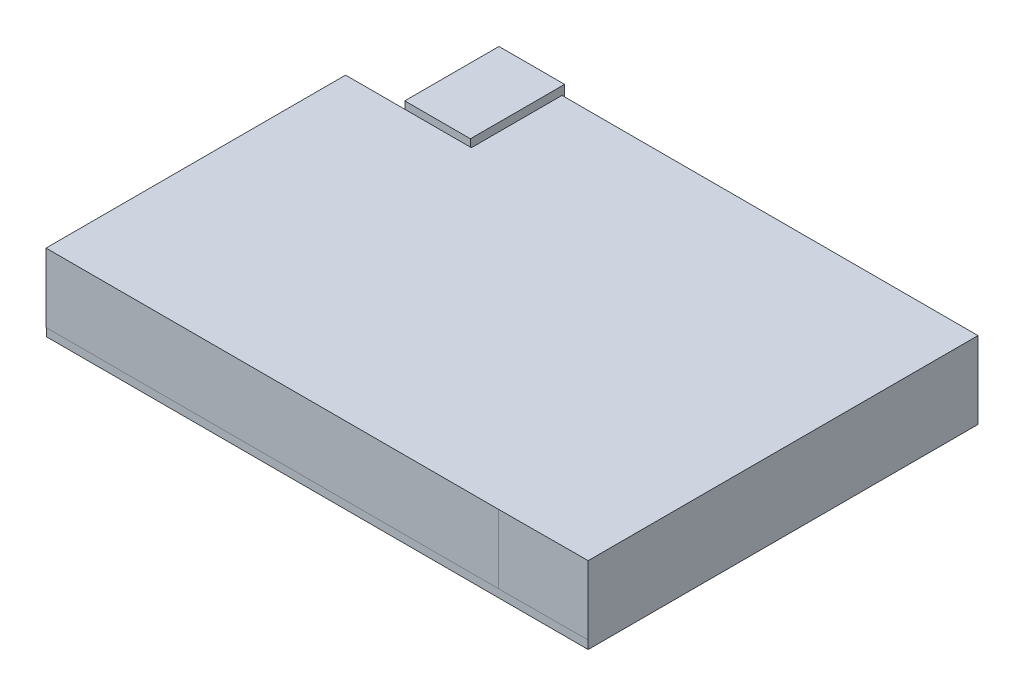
ISO-10303-21;
HEADER;
FILE_DESCRIPTION(('STEP AP214'),'2;1');
FILE_NAME('part.step','',(''),(''),'','','');
FILE_SCHEMA(('AUTOMOTIVE_DESIGN { 1 0 10303 214 1 1 1 1 }'));
ENDSEC;
DATA;
#1=APPLICATION_CONTEXT('core data for automotive mechanical design processes');
#2=APPLICATION_PROTOCOL_DEFINITION('international standard','automotive_design',2000,#1);
#3=PRODUCT_CONTEXT('',#1,'mechanical');
#4=PRODUCT('Part','Part','',(#3));
#5=PRODUCT_RELATED_PRODUCT_CATEGORY('part','',(#4));
#6=PRODUCT_DEFINITION_FORMATION('','',#4);
#7=PRODUCT_DEFINITION_CONTEXT('part definition',#1,'design');
#8=PRODUCT_DEFINITION('design','',#6,#7);
#9=PRODUCT_DEFINITION_SHAPE('','',#8);
#10=(LENGTH_UNIT() NAMED_UNIT(*) SI_UNIT(.MILLI.,.METRE.));
#11=(NAMED_UNIT(*) PLANE_ANGLE_UNIT() SI_UNIT($,.RADIAN.));
#12=(NAMED_UNIT(*) SI_UNIT($,.STERADIAN.) SOLID_ANGLE_UNIT());
#13=UNCERTAINTY_MEASURE_WITH_UNIT(LENGTH_MEASURE(1.E-05),#10,'distance_accuracy_value','');
#14=(GEOMETRIC_REPRESENTATION_CONTEXT(3) GLOBAL_UNCERTAINTY_ASSIGNED_CONTEXT((#13)) GLOBAL_UNIT_ASSIGNED_CONTEXT((#10,
#11,#12)) REPRESENTATION_CONTEXT('',''));
#15=CARTESIAN_POINT('',(0.,0.,0.));
#16=DIRECTION('',(0.,0.,1.));
#17=DIRECTION('',(1.,0.,0.));
#18=AXIS2_PLACEMENT_3D('',#15,#16,#17);
#19=CARTESIAN_POINT('',(0.,1.524,0.));
#20=DIRECTION('',(0.,1.,0.));
#21=DIRECTION('',(0.,0.,1.));
#22=AXIS2_PLACEMENT_3D('',#19,#20,#21);
#23=PLANE('',#22);
#24=CARTESIAN_POINT('',(-47.0916,1.524,-32.9565));
#25=DIRECTION('',(0.,1.,0.));
#26=DIRECTION('',(0.,0.,1.));
#27=AXIS2_PLACEMENT_3D('',#24,#25,#26);
#28=CIRCLE('',#27,1.72719999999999);
#29=CARTESIAN_POINT('',(-47.0916,1.524,-31.2293));
#30=VERTEX_POINT('',#29);
#31=EDGE_CURVE('E205',#30,#30,#28,.T.);
#32=ORIENTED_EDGE('',*,*,#31,.F.);
#33=EDGE_LOOP('',(#32));
#34=FACE_BOUND('',#33,.T.);
#35=DIRECTION('',(-1.,0.,0.));
#36=VECTOR('',#35,1.);
#37=CARTESIAN_POINT('',(-50.038,1.524,-19.2623606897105));
#38=LINE('',#37,#36);
#39=CARTESIAN_POINT('',(-26.8018549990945,1.524,-19.2623606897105));
#40=VERTEX_POINT('',#39);
#41=CARTESIAN_POINT('',(-50.038,1.524,-19.2623606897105));
#42=VERTEX_POINT('',#41);
#43=EDGE_CURVE('E157',#40,#42,#38,.T.);
#44=ORIENTED_EDGE('',*,*,#43,.F.);
#45=DIRECTION('',(0.,0.,1.));
#46=VECTOR('',#45,1.);
#47=CARTESIAN_POINT('',(-26.8018549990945,1.524,-19.2623606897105));
#48=LINE('',#47,#46);
#49=CARTESIAN_POINT('',(-26.8018549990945,1.524,-36.0045));
#50=VERTEX_POINT('',#49);
#51=EDGE_CURVE('E274',#50,#40,#48,.T.);
#52=ORIENTED_EDGE('',*,*,#51,.F.);
#53=DIRECTION('',(-1.,0.,0.));
#54=VECTOR('',#53,1.);
#55=CARTESIAN_POINT('',(-50.038,1.524,-36.0045));
#56=LINE('',#55,#54);
#57=CARTESIAN_POINT('',(-28.3277250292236,1.524,-36.0045));
#58=VERTEX_POINT('',#57);
#59=EDGE_CURVE('E221',#50,#58,#56,.T.);
#60=ORIENTED_EDGE('',*,*,#59,.T.);
#61=DIRECTION('',(0.,0.,-1.));
#62=VECTOR('',#61,1.);
#63=CARTESIAN_POINT('',(-28.3277250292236,1.524,-38.0117257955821));
#64=LINE('',#63,#62);
#65=CARTESIAN_POINT('',(-28.3277250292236,1.524,-20.6111319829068));
#66=VERTEX_POINT('',#65);
#67=EDGE_CURVE('E57',#66,#58,#64,.T.);
#68=ORIENTED_EDGE('',*,*,#67,.F.);
#69=DIRECTION('',(1.,0.,0.));
#70=VECTOR('',#69,1.);
#71=CARTESIAN_POINT('',(-28.3277250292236,1.524,-20.6111319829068));
#72=LINE('',#71,#70);
#73=CARTESIAN_POINT('',(-40.4554116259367,1.524,-20.6111319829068));
#74=VERTEX_POINT('',#73);
#75=EDGE_CURVE('E182',#74,#66,#72,.T.);
#76=ORIENTED_EDGE('',*,*,#75,.F.);
#77=DIRECTION('',(0.,0.,1.));
#78=VECTOR('',#77,1.);
#79=CARTESIAN_POINT('',(-40.4554116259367,1.524,-38.0117257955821));
#80=LINE('',#79,#78);
#81=CARTESIAN_POINT('',(-40.4554116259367,1.524,-36.0045));
#82=VERTEX_POINT('',#81);
#83=EDGE_CURVE('E11',#82,#74,#80,.T.);
#84=ORIENTED_EDGE('',*,*,#83,.F.);
#85=CARTESIAN_POINT('',(-50.038,1.524,-36.0045));
#86=VERTEX_POINT('',#85);
#87=EDGE_CURVE('E225',#82,#86,#56,.T.);
#88=ORIENTED_EDGE('',*,*,#87,.T.);
#89=DIRECTION('',(0.,0.,1.));
#90=VECTOR('',#89,1.);
#91=CARTESIAN_POINT('',(-50.038,1.524,-36.0045));
#92=LINE('',#91,#90);
#93=EDGE_CURVE('E223',#86,#42,#92,.T.);
#94=ORIENTED_EDGE('',*,*,#93,.T.);
#95=EDGE_LOOP('',(#44,#52,#60,#68,#76,#84,#88,#94));
#96=FACE_BOUND('',#95,.T.);
#97=ADVANCED_FACE('F32',(#34,#96),#23,.T.);
#98=CARTESIAN_POINT('',(50.038,1.524,-36.0045));
#99=DIRECTION('',(-1.,0.,0.));
#100=DIRECTION('',(0.,0.,1.));
#101=AXIS2_PLACEMENT_3D('',#98,#99,#100);
#102=PLANE('',#101);
#103=DIRECTION('',(0.,0.,-1.));
#104=VECTOR('',#103,1.);
#105=CARTESIAN_POINT('',(50.038,0.,-36.0045));
#106=LINE('',#105,#104);
#107=CARTESIAN_POINT('',(50.038,0.,36.0045));
#108=VERTEX_POINT('',#107);
#109=CARTESIAN_POINT('',(50.038,0.,-36.0045));
#110=VERTEX_POINT('',#109);
#111=EDGE_CURVE('E220',#108,#110,#106,.T.);
#112=ORIENTED_EDGE('',*,*,#111,.T.);
#113=DIRECTION('',(0.,-1.,0.));
#114=VECTOR('',#113,1.);
#115=CARTESIAN_POINT('',(50.038,1.524,-36.0045));
#116=LINE('',#115,#114);
#117=CARTESIAN_POINT('',(50.038,14.224,-36.0045));
#118=VERTEX_POINT('',#117);
#119=EDGE_CURVE('E36',#118,#110,#116,.T.);
#120=ORIENTED_EDGE('',*,*,#119,.F.);
#121=DIRECTION('',(0.,0.,-1.));
#122=VECTOR('',#121,1.);
#123=CARTESIAN_POINT('',(50.038,14.224,-36.0045));
#124=LINE('',#123,#122);
#125=CARTESIAN_POINT('',(50.038,14.224,36.0045));
#126=VERTEX_POINT('',#125);
#127=EDGE_CURVE('E277',#126,#118,#124,.T.);
#128=ORIENTED_EDGE('',*,*,#127,.F.);
#129=DIRECTION('',(0.,-1.,0.));
#130=VECTOR('',#129,1.);
#131=CARTESIAN_POINT('',(50.038,14.224,36.0045));
#132=LINE('',#131,#130);
#133=CARTESIAN_POINT('',(50.038,1.524,36.0045));
#134=VERTEX_POINT('',#133);
#135=EDGE_CURVE('E168',#126,#134,#132,.T.);
#136=ORIENTED_EDGE('',*,*,#135,.T.);
#137=DIRECTION('',(0.,-1.,0.));
#138=VECTOR('',#137,1.);
#139=CARTESIAN_POINT('',(50.038,1.524,36.0045));
#140=LINE('',#139,#138);
#141=EDGE_CURVE('E230',#134,#108,#140,.T.);
#142=ORIENTED_EDGE('',*,*,#141,.T.);
#143=EDGE_LOOP('',(#112,#120,#128,#136,#142));
#144=FACE_BOUND('',#143,.T.);
#145=ADVANCED_FACE('F34',(#144),#102,.F.);
#146=CARTESIAN_POINT('',(-50.038,1.524,-36.0045));
#147=DIRECTION('',(0.,0.,1.));
#148=DIRECTION('',(1.,0.,0.));
#149=AXIS2_PLACEMENT_3D('',#146,#147,#148);
#150=PLANE('',#149);
#151=DIRECTION('',(-1.,0.,0.));
#152=VECTOR('',#151,1.);
#153=CARTESIAN_POINT('',(-50.038,0.,-36.0045));
#154=LINE('',#153,#152);
#155=CARTESIAN_POINT('',(-50.038,0.,-36.0045));
#156=VERTEX_POINT('',#155);
#157=EDGE_CURVE('E233',#110,#156,#154,.T.);
#158=ORIENTED_EDGE('',*,*,#157,.T.);
#159=DIRECTION('',(0.,-1.,0.));
#160=VECTOR('',#159,1.);
#161=CARTESIAN_POINT('',(-50.038,1.524,-36.0045));
#162=LINE('',#161,#160);
#163=EDGE_CURVE('E243',#86,#156,#162,.T.);
#164=ORIENTED_EDGE('',*,*,#163,.F.);
#165=ORIENTED_EDGE('',*,*,#87,.F.);
#166=EDGE_CURVE('E224',#58,#82,#56,.T.);
#167=ORIENTED_EDGE('',*,*,#166,.F.);
#168=ORIENTED_EDGE('',*,*,#59,.F.);
#169=DIRECTION('',(0.,-1.,0.));
#170=VECTOR('',#169,1.);
#171=CARTESIAN_POINT('',(-26.8018549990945,14.224,-36.0045));
#172=LINE('',#171,#170);
#173=CARTESIAN_POINT('',(-26.8018549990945,14.224,-36.0045));
#174=VERTEX_POINT('',#173);
#175=EDGE_CURVE('E278',#174,#50,#172,.T.);
#176=ORIENTED_EDGE('',*,*,#175,.F.);
#177=DIRECTION('',(-1.,0.,0.));
#178=VECTOR('',#177,1.);
#179=CARTESIAN_POINT('',(-26.8018549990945,14.224,-36.0045));
#180=LINE('',#179,#178);
#181=EDGE_CURVE('E253',#118,#174,#180,.T.);
#182=ORIENTED_EDGE('',*,*,#181,.F.);
#183=ORIENTED_EDGE('',*,*,#119,.T.);
#184=EDGE_LOOP('',(#158,#164,#165,#167,#168,#176,#182,#183));
#185=FACE_BOUND('',#184,.T.);
#186=ADVANCED_FACE('F251',(#185),#150,.F.);
#187=CARTESIAN_POINT('',(-50.038,1.524,-36.0045));
#188=DIRECTION('',(1.,0.,0.));
#189=DIRECTION('',(0.,0.,-1.));
#190=AXIS2_PLACEMENT_3D('',#187,#188,#189);
#191=PLANE('',#190);
#192=DIRECTION('',(0.,0.,1.));
#193=VECTOR('',#192,1.);
#194=CARTESIAN_POINT('',(-50.038,0.,-36.0045));
#195=LINE('',#194,#193);
#196=CARTESIAN_POINT('',(-50.038,0.,36.0045));
#197=VERTEX_POINT('',#196);
#198=EDGE_CURVE('E235',#156,#197,#195,.T.);
#199=ORIENTED_EDGE('',*,*,#198,.T.);
#200=DIRECTION('',(0.,-1.,0.));
#201=VECTOR('',#200,1.);
#202=CARTESIAN_POINT('',(-50.038,1.524,36.0045));
#203=LINE('',#202,#201);
#204=CARTESIAN_POINT('',(-50.038,1.524,36.0045));
#205=VERTEX_POINT('',#204);
#206=EDGE_CURVE('E241',#205,#197,#203,.T.);
#207=ORIENTED_EDGE('',*,*,#206,.F.);
#208=DIRECTION('',(0.,0.,1.));
#209=VECTOR('',#208,1.);
#210=CARTESIAN_POINT('',(-50.038,1.524,-19.2623606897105));
#211=LINE('',#210,#209);
#212=CARTESIAN_POINT('',(-50.038,1.524,36.0750617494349));
#213=VERTEX_POINT('',#212);
#214=EDGE_CURVE('E161',#205,#213,#211,.T.);
#215=ORIENTED_EDGE('',*,*,#214,.T.);
#216=DIRECTION('',(0.,-1.,0.));
#217=VECTOR('',#216,1.);
#218=CARTESIAN_POINT('',(-50.038,14.224,36.0750617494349));
#219=LINE('',#218,#217);
#220=CARTESIAN_POINT('',(-50.038,14.224,36.0750617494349));
#221=VERTEX_POINT('',#220);
#222=EDGE_CURVE('E143',#221,#213,#219,.T.);
#223=ORIENTED_EDGE('',*,*,#222,.F.);
#224=DIRECTION('',(0.,0.,1.));
#225=VECTOR('',#224,1.);
#226=CARTESIAN_POINT('',(-50.038,14.224,-19.2623606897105));
#227=LINE('',#226,#225);
#228=CARTESIAN_POINT('',(-50.038,14.224,-19.2623606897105));
#229=VERTEX_POINT('',#228);
#230=EDGE_CURVE('E149',#229,#221,#227,.T.);
#231=ORIENTED_EDGE('',*,*,#230,.F.);
#232=DIRECTION('',(0.,-1.,0.));
#233=VECTOR('',#232,1.);
#234=CARTESIAN_POINT('',(-50.038,14.224,-19.2623606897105));
#235=LINE('',#234,#233);
#236=EDGE_CURVE('E282',#229,#42,#235,.T.);
#237=ORIENTED_EDGE('',*,*,#236,.T.);
#238=ORIENTED_EDGE('',*,*,#93,.F.);
#239=ORIENTED_EDGE('',*,*,#163,.T.);
#240=EDGE_LOOP('',(#199,#207,#215,#223,#231,#237,#238,#239));
#241=FACE_BOUND('',#240,.T.);
#242=ADVANCED_FACE('F159',(#241),#191,.F.);
#243=CARTESIAN_POINT('',(-50.038,1.524,36.0045));
#244=DIRECTION('',(0.,0.,-1.));
#245=DIRECTION('',(-1.,0.,0.));
#246=AXIS2_PLACEMENT_3D('',#243,#244,#245);
#247=PLANE('',#246);
#248=DIRECTION('',(1.,0.,0.));
#249=VECTOR('',#248,1.);
#250=CARTESIAN_POINT('',(-50.038,0.,36.0045));
#251=LINE('',#250,#249);
#252=EDGE_CURVE('E237',#197,#108,#251,.T.);
#253=ORIENTED_EDGE('',*,*,#252,.T.);
#254=ORIENTED_EDGE('',*,*,#141,.F.);
#255=DIRECTION('',(1.,0.,0.));
#256=VECTOR('',#255,1.);
#257=CARTESIAN_POINT('',(-50.038,1.524,36.0045));
#258=LINE('',#257,#256);
#259=EDGE_CURVE('E228',#205,#134,#258,.T.);
#260=ORIENTED_EDGE('',*,*,#259,.F.);
#261=ORIENTED_EDGE('',*,*,#206,.T.);
#262=EDGE_LOOP('',(#253,#254,#260,#261));
#263=FACE_BOUND('',#262,.T.);
#264=ADVANCED_FACE('F265',(#263),#247,.F.);
#265=CARTESIAN_POINT('',(0.,0.,0.));
#266=DIRECTION('',(0.,1.,0.));
#267=DIRECTION('',(0.,0.,1.));
#268=AXIS2_PLACEMENT_3D('',#265,#266,#267);
#269=PLANE('',#268);
#270=CARTESIAN_POINT('',(-47.0916,0.,-32.9565));
#271=DIRECTION('',(0.,1.,0.));
#272=DIRECTION('',(0.,0.,1.));
#273=AXIS2_PLACEMENT_3D('',#270,#271,#272);
#274=CIRCLE('',#273,1.7272);
#275=CARTESIAN_POINT('',(-47.0916,0.,-31.2293));
#276=VERTEX_POINT('',#275);
#277=EDGE_CURVE('E208',#276,#276,#274,.T.);
#278=ORIENTED_EDGE('',*,*,#277,.T.);
#279=EDGE_LOOP('',(#278));
#280=FACE_BOUND('',#279,.T.);
#281=CARTESIAN_POINT('',(47.0662,0.,-32.9565));
#282=DIRECTION('',(0.,1.,0.));
#283=DIRECTION('',(0.,0.,1.));
#284=AXIS2_PLACEMENT_3D('',#281,#282,#283);
#285=CIRCLE('',#284,1.7272);
#286=CARTESIAN_POINT('',(47.0662,0.,-31.2293));
#287=VERTEX_POINT('',#286);
#288=EDGE_CURVE('E211',#287,#287,#285,.T.);
#289=ORIENTED_EDGE('',*,*,#288,.T.);
#290=EDGE_LOOP('',(#289));
#291=FACE_BOUND('',#290,.T.);
#292=CARTESIAN_POINT('',(-47.0916,0.,33.0835));
#293=DIRECTION('',(0.,1.,0.));
#294=DIRECTION('',(0.,0.,1.));
#295=AXIS2_PLACEMENT_3D('',#292,#293,#294);
#296=CIRCLE('',#295,1.7272);
#297=CARTESIAN_POINT('',(-47.0916,0.,34.8107));
#298=VERTEX_POINT('',#297);
#299=EDGE_CURVE('E214',#298,#298,#296,.T.);
#300=ORIENTED_EDGE('',*,*,#299,.T.);
#301=EDGE_LOOP('',(#300));
#302=FACE_BOUND('',#301,.T.);
#303=CARTESIAN_POINT('',(47.0662,0.,33.0835));
#304=DIRECTION('',(0.,1.,0.));
#305=DIRECTION('',(0.,0.,1.));
#306=AXIS2_PLACEMENT_3D('',#303,#304,#305);
#307=CIRCLE('',#306,1.7272);
#308=CARTESIAN_POINT('',(47.0662,0.,34.8107));
#309=VERTEX_POINT('',#308);
#310=EDGE_CURVE('E217',#309,#309,#307,.T.);
#311=ORIENTED_EDGE('',*,*,#310,.T.);
#312=EDGE_LOOP('',(#311));
#313=FACE_BOUND('',#312,.T.);
#314=ORIENTED_EDGE('',*,*,#111,.F.);
#315=ORIENTED_EDGE('',*,*,#252,.F.);
#316=ORIENTED_EDGE('',*,*,#198,.F.);
#317=ORIENTED_EDGE('',*,*,#157,.F.);
#318=EDGE_LOOP('',(#314,#315,#316,#317));
#319=FACE_BOUND('',#318,.T.);
#320=ADVANCED_FACE('F262',(#280,#291,#302,#313,#319),#269,.F.);
#321=CARTESIAN_POINT('',(47.0662,1.524,33.0835));
#322=DIRECTION('',(0.,1.,0.));
#323=DIRECTION('',(0.,0.,1.));
#324=AXIS2_PLACEMENT_3D('',#321,#322,#323);
#325=CYLINDRICAL_SURFACE('',#324,1.72719999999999);
#326=ORIENTED_EDGE('',*,*,#310,.F.);
#327=EDGE_LOOP('',(#326));
#328=FACE_BOUND('',#327,.T.);
#329=CARTESIAN_POINT('',(47.0662,1.524,33.0835));
#330=DIRECTION('',(0.,1.,0.));
#331=DIRECTION('',(0.,0.,1.));
#332=AXIS2_PLACEMENT_3D('',#329,#330,#331);
#333=CIRCLE('',#332,1.72719999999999);
#334=CARTESIAN_POINT('',(47.0662,1.524,34.8107));
#335=VERTEX_POINT('',#334);
#336=EDGE_CURVE('E174',#335,#335,#333,.F.);
#337=ORIENTED_EDGE('',*,*,#336,.F.);
#338=EDGE_LOOP('',(#337));
#339=FACE_BOUND('',#338,.T.);
#340=ADVANCED_FACE('F344',(#328,#339),#325,.F.);
#341=CARTESIAN_POINT('',(-47.0916,1.524,33.0835));
#342=DIRECTION('',(0.,1.,0.));
#343=DIRECTION('',(0.,0.,1.));
#344=AXIS2_PLACEMENT_3D('',#341,#342,#343);
#345=CYLINDRICAL_SURFACE('',#344,1.72719999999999);
#346=ORIENTED_EDGE('',*,*,#299,.F.);
#347=EDGE_LOOP('',(#346));
#348=FACE_BOUND('',#347,.T.);
#349=CARTESIAN_POINT('',(-47.0916,1.524,33.0835));
#350=DIRECTION('',(0.,1.,0.));
#351=DIRECTION('',(0.,0.,1.));
#352=AXIS2_PLACEMENT_3D('',#349,#350,#351);
#353=CIRCLE('',#352,1.72719999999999);
#354=CARTESIAN_POINT('',(-47.0916,1.524,34.8107));
#355=VERTEX_POINT('',#354);
#356=EDGE_CURVE('E166',#355,#355,#353,.F.);
#357=ORIENTED_EDGE('',*,*,#356,.F.);
#358=EDGE_LOOP('',(#357));
#359=FACE_BOUND('',#358,.T.);
#360=ADVANCED_FACE('F376',(#348,#359),#345,.F.);
#361=CARTESIAN_POINT('',(47.0662,1.524,-32.9565));
#362=DIRECTION('',(0.,1.,0.));
#363=DIRECTION('',(0.,0.,1.));
#364=AXIS2_PLACEMENT_3D('',#361,#362,#363);
#365=CYLINDRICAL_SURFACE('',#364,1.72719999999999);
#366=ORIENTED_EDGE('',*,*,#288,.F.);
#367=EDGE_LOOP('',(#366));
#368=FACE_BOUND('',#367,.T.);
#369=CARTESIAN_POINT('',(47.0662,1.524,-32.9565));
#370=DIRECTION('',(0.,1.,0.));
#371=DIRECTION('',(0.,0.,1.));
#372=AXIS2_PLACEMENT_3D('',#369,#370,#371);
#373=CIRCLE('',#372,1.72719999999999);
#374=CARTESIAN_POINT('',(47.0662,1.524,-31.2293));
#375=VERTEX_POINT('',#374);
#376=EDGE_CURVE('E163',#375,#375,#373,.F.);
#377=ORIENTED_EDGE('',*,*,#376,.F.);
#378=EDGE_LOOP('',(#377));
#379=FACE_BOUND('',#378,.T.);
#380=ADVANCED_FACE('F383',(#368,#379),#365,.F.);
#381=CARTESIAN_POINT('',(-47.0916,1.524,-32.9565));
#382=DIRECTION('',(0.,1.,0.));
#383=DIRECTION('',(0.,0.,1.));
#384=AXIS2_PLACEMENT_3D('',#381,#382,#383);
#385=CYLINDRICAL_SURFACE('',#384,1.72719999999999);
#386=ORIENTED_EDGE('',*,*,#277,.F.);
#387=EDGE_LOOP('',(#386));
#388=FACE_BOUND('',#387,.T.);
#389=ORIENTED_EDGE('',*,*,#31,.T.);
#390=EDGE_LOOP('',(#389));
#391=FACE_BOUND('',#390,.T.);
#392=ADVANCED_FACE('F390',(#388,#391),#385,.F.);
#393=CARTESIAN_POINT('',(-28.3277250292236,14.224,-38.0117257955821));
#394=DIRECTION('',(-1.,0.,0.));
#395=DIRECTION('',(0.,0.,1.));
#396=AXIS2_PLACEMENT_3D('',#393,#394,#395);
#397=PLANE('',#396);
#398=ORIENTED_EDGE('',*,*,#67,.T.);
#399=CARTESIAN_POINT('',(-28.3277250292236,1.524,-38.0117257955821));
#400=VERTEX_POINT('',#399);
#401=EDGE_CURVE('E177',#58,#400,#64,.T.);
#402=ORIENTED_EDGE('',*,*,#401,.T.);
#403=DIRECTION('',(0.,-1.,0.));
#404=VECTOR('',#403,1.);
#405=CARTESIAN_POINT('',(-28.3277250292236,14.224,-38.0117257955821));
#406=LINE('',#405,#404);
#407=CARTESIAN_POINT('',(-28.3277250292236,14.224,-38.0117257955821));
#408=VERTEX_POINT('',#407);
#409=EDGE_CURVE('E202',#408,#400,#406,.T.);
#410=ORIENTED_EDGE('',*,*,#409,.F.);
#411=DIRECTION('',(0.,0.,-1.));
#412=VECTOR('',#411,1.);
#413=CARTESIAN_POINT('',(-28.3277250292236,14.224,-38.0117257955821));
#414=LINE('',#413,#412);
#415=CARTESIAN_POINT('',(-28.3277250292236,14.224,-20.6111319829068));
#416=VERTEX_POINT('',#415);
#417=EDGE_CURVE('E178',#416,#408,#414,.T.);
#418=ORIENTED_EDGE('',*,*,#417,.F.);
#419=DIRECTION('',(0.,-1.,0.));
#420=VECTOR('',#419,1.);
#421=CARTESIAN_POINT('',(-28.3277250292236,14.224,-20.6111319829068));
#422=LINE('',#421,#420);
#423=EDGE_CURVE('E188',#416,#66,#422,.T.);
#424=ORIENTED_EDGE('',*,*,#423,.T.);
#425=EDGE_LOOP('',(#398,#402,#410,#418,#424));
#426=FACE_BOUND('',#425,.T.);
#427=ADVANCED_FACE('F318',(#426),#397,.F.);
#428=CARTESIAN_POINT('',(-28.3277250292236,14.224,-38.0117257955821));
#429=DIRECTION('',(0.,0.,1.));
#430=DIRECTION('',(1.,0.,0.));
#431=AXIS2_PLACEMENT_3D('',#428,#429,#430);
#432=PLANE('',#431);
#433=DIRECTION('',(-1.,0.,0.));
#434=VECTOR('',#433,1.);
#435=CARTESIAN_POINT('',(-28.3277250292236,1.524,-38.0117257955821));
#436=LINE('',#435,#434);
#437=CARTESIAN_POINT('',(-40.4554116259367,1.524,-38.0117257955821));
#438=VERTEX_POINT('',#437);
#439=EDGE_CURVE('E190',#400,#438,#436,.T.);
#440=ORIENTED_EDGE('',*,*,#439,.T.);
#441=DIRECTION('',(0.,-1.,0.));
#442=VECTOR('',#441,1.);
#443=CARTESIAN_POINT('',(-40.4554116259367,14.224,-38.0117257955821));
#444=LINE('',#443,#442);
#445=CARTESIAN_POINT('',(-40.4554116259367,14.224,-38.0117257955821));
#446=VERTEX_POINT('',#445);
#447=EDGE_CURVE('E199',#446,#438,#444,.T.);
#448=ORIENTED_EDGE('',*,*,#447,.F.);
#449=DIRECTION('',(-1.,0.,0.));
#450=VECTOR('',#449,1.);
#451=CARTESIAN_POINT('',(-28.3277250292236,14.224,-38.0117257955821));
#452=LINE('',#451,#450);
#453=EDGE_CURVE('E181',#408,#446,#452,.T.);
#454=ORIENTED_EDGE('',*,*,#453,.F.);
#455=ORIENTED_EDGE('',*,*,#409,.T.);
#456=EDGE_LOOP('',(#440,#448,#454,#455));
#457=FACE_BOUND('',#456,.T.);
#458=ADVANCED_FACE('F314',(#457),#432,.F.);
#459=CARTESIAN_POINT('',(-40.4554116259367,14.224,-38.0117257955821));
#460=DIRECTION('',(1.,0.,0.));
#461=DIRECTION('',(0.,0.,-1.));
#462=AXIS2_PLACEMENT_3D('',#459,#460,#461);
#463=PLANE('',#462);
#464=EDGE_CURVE('E42',#438,#82,#80,.T.);
#465=ORIENTED_EDGE('',*,*,#464,.T.);
#466=ORIENTED_EDGE('',*,*,#83,.T.);
#467=DIRECTION('',(0.,-1.,0.));
#468=VECTOR('',#467,1.);
#469=CARTESIAN_POINT('',(-40.4554116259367,14.224,-20.6111319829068));
#470=LINE('',#469,#468);
#471=CARTESIAN_POINT('',(-40.4554116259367,14.224,-20.6111319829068));
#472=VERTEX_POINT('',#471);
#473=EDGE_CURVE('E196',#472,#74,#470,.T.);
#474=ORIENTED_EDGE('',*,*,#473,.F.);
#475=DIRECTION('',(0.,0.,1.));
#476=VECTOR('',#475,1.);
#477=CARTESIAN_POINT('',(-40.4554116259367,14.224,-38.0117257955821));
#478=LINE('',#477,#476);
#479=EDGE_CURVE('E184',#446,#472,#478,.T.);
#480=ORIENTED_EDGE('',*,*,#479,.F.);
#481=ORIENTED_EDGE('',*,*,#447,.T.);
#482=EDGE_LOOP('',(#465,#466,#474,#480,#481));
#483=FACE_BOUND('',#482,.T.);
#484=ADVANCED_FACE('F309',(#483),#463,.F.);
#485=CARTESIAN_POINT('',(-28.3277250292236,14.224,-20.6111319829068));
#486=DIRECTION('',(0.,0.,-1.));
#487=DIRECTION('',(-1.,0.,0.));
#488=AXIS2_PLACEMENT_3D('',#485,#486,#487);
#489=PLANE('',#488);
#490=ORIENTED_EDGE('',*,*,#75,.T.);
#491=ORIENTED_EDGE('',*,*,#423,.F.);
#492=DIRECTION('',(1.,0.,0.));
#493=VECTOR('',#492,1.);
#494=CARTESIAN_POINT('',(-28.3277250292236,14.224,-20.6111319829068));
#495=LINE('',#494,#493);
#496=EDGE_CURVE('E186',#472,#416,#495,.T.);
#497=ORIENTED_EDGE('',*,*,#496,.F.);
#498=ORIENTED_EDGE('',*,*,#473,.T.);
#499=EDGE_LOOP('',(#490,#491,#497,#498));
#500=FACE_BOUND('',#499,.T.);
#501=ADVANCED_FACE('F322',(#500),#489,.F.);
#502=CARTESIAN_POINT('',(0.,14.224,0.));
#503=DIRECTION('',(0.,-1.,0.));
#504=DIRECTION('',(0.,0.,-1.));
#505=AXIS2_PLACEMENT_3D('',#502,#503,#504);
#506=PLANE('',#505);
#507=ORIENTED_EDGE('',*,*,#417,.T.);
#508=ORIENTED_EDGE('',*,*,#453,.T.);
#509=ORIENTED_EDGE('',*,*,#479,.T.);
#510=ORIENTED_EDGE('',*,*,#496,.T.);
#511=EDGE_LOOP('',(#507,#508,#509,#510));
#512=FACE_BOUND('',#511,.T.);
#513=ADVANCED_FACE('F324',(#512),#506,.F.);
#514=CARTESIAN_POINT('',(0.,1.524,0.));
#515=DIRECTION('',(0.,-1.,0.));
#516=DIRECTION('',(0.,0.,-1.));
#517=AXIS2_PLACEMENT_3D('',#514,#515,#516);
#518=PLANE('',#517);
#519=ORIENTED_EDGE('',*,*,#401,.F.);
#520=ORIENTED_EDGE('',*,*,#166,.T.);
#521=ORIENTED_EDGE('',*,*,#464,.F.);
#522=ORIENTED_EDGE('',*,*,#439,.F.);
#523=EDGE_LOOP('',(#519,#520,#521,#522));
#524=FACE_BOUND('',#523,.T.);
#525=ADVANCED_FACE('F306',(#524),#518,.T.);
#526=CARTESIAN_POINT('',(0.,1.524,0.));
#527=DIRECTION('',(0.,1.,0.));
#528=DIRECTION('',(0.,0.,1.));
#529=AXIS2_PLACEMENT_3D('',#526,#527,#528);
#530=PLANE('',#529);
#531=ORIENTED_EDGE('',*,*,#376,.T.);
#532=EDGE_LOOP('',(#531));
#533=FACE_BOUND('',#532,.T.);
#534=ADVANCED_FACE('F331',(#533),#530,.F.);
#535=ORIENTED_EDGE('',*,*,#356,.T.);
#536=EDGE_LOOP('',(#535));
#537=FACE_BOUND('',#536,.T.);
#538=ADVANCED_FACE('F461',(#537),#530,.F.);
#539=ORIENTED_EDGE('',*,*,#336,.T.);
#540=EDGE_LOOP('',(#539));
#541=FACE_BOUND('',#540,.T.);
#542=ADVANCED_FACE('F470',(#541),#530,.F.);
#543=ORIENTED_EDGE('',*,*,#214,.F.);
#544=ORIENTED_EDGE('',*,*,#259,.T.);
#545=DIRECTION('',(0.99999088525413,0.,-0.00426959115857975));
#546=VECTOR('',#545,1.);
#547=CARTESIAN_POINT('',(50.038,1.524,36.0045));
#548=LINE('',#547,#546);
#549=CARTESIAN_POINT('',(33.5115683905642,1.524,36.0750617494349));
#550=VERTEX_POINT('',#549);
#551=EDGE_CURVE('E270',#550,#134,#548,.T.);
#552=ORIENTED_EDGE('',*,*,#551,.F.);
#553=DIRECTION('',(1.,0.,0.));
#554=VECTOR('',#553,1.);
#555=CARTESIAN_POINT('',(-50.038,1.524,36.0750617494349));
#556=LINE('',#555,#554);
#557=EDGE_CURVE('E275',#213,#550,#556,.T.);
#558=ORIENTED_EDGE('',*,*,#557,.F.);
#559=EDGE_LOOP('',(#543,#544,#552,#558));
#560=FACE_BOUND('',#559,.T.);
#561=ADVANCED_FACE('F269',(#560),#530,.F.);
#562=CARTESIAN_POINT('',(-50.038,14.224,36.0750617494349));
#563=DIRECTION('',(0.,0.,-1.));
#564=DIRECTION('',(-1.,0.,0.));
#565=AXIS2_PLACEMENT_3D('',#562,#563,#564);
#566=PLANE('',#565);
#567=ORIENTED_EDGE('',*,*,#557,.T.);
#568=DIRECTION('',(0.,-1.,0.));
#569=VECTOR('',#568,1.);
#570=CARTESIAN_POINT('',(33.5115683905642,14.224,36.0750617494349));
#571=LINE('',#570,#569);
#572=CARTESIAN_POINT('',(33.5115683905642,14.224,36.0750617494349));
#573=VERTEX_POINT('',#572);
#574=EDGE_CURVE('E145',#573,#550,#571,.T.);
#575=ORIENTED_EDGE('',*,*,#574,.F.);
#576=DIRECTION('',(1.,0.,0.));
#577=VECTOR('',#576,1.);
#578=CARTESIAN_POINT('',(-50.038,14.224,36.0750617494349));
#579=LINE('',#578,#577);
#580=EDGE_CURVE('E139',#221,#573,#579,.T.);
#581=ORIENTED_EDGE('',*,*,#580,.F.);
#582=ORIENTED_EDGE('',*,*,#222,.T.);
#583=EDGE_LOOP('',(#567,#575,#581,#582));
#584=FACE_BOUND('',#583,.T.);
#585=ADVANCED_FACE('F141',(#584),#566,.F.);
#586=CARTESIAN_POINT('',(50.038,14.224,36.0045));
#587=DIRECTION('',(-0.00426959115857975,0.,-0.99999088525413));
#588=DIRECTION('',(-0.99999088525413,0.,0.00426959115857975));
#589=AXIS2_PLACEMENT_3D('',#586,#587,#588);
#590=PLANE('',#589);
#591=ORIENTED_EDGE('',*,*,#551,.T.);
#592=ORIENTED_EDGE('',*,*,#135,.F.);
#593=DIRECTION('',(0.99999088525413,0.,-0.00426959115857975));
#594=VECTOR('',#593,1.);
#595=CARTESIAN_POINT('',(50.038,14.224,36.0045));
#596=LINE('',#595,#594);
#597=EDGE_CURVE('E148',#573,#126,#596,.T.);
#598=ORIENTED_EDGE('',*,*,#597,.F.);
#599=ORIENTED_EDGE('',*,*,#574,.T.);
#600=EDGE_LOOP('',(#591,#592,#598,#599));
#601=FACE_BOUND('',#600,.T.);
#602=ADVANCED_FACE('F273',(#601),#590,.F.);
#603=CARTESIAN_POINT('',(-26.8018549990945,14.224,-19.2623606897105));
#604=DIRECTION('',(1.,0.,0.));
#605=DIRECTION('',(0.,0.,-1.));
#606=AXIS2_PLACEMENT_3D('',#603,#604,#605);
#607=PLANE('',#606);
#608=ORIENTED_EDGE('',*,*,#51,.T.);
#609=DIRECTION('',(0.,-1.,0.));
#610=VECTOR('',#609,1.);
#611=CARTESIAN_POINT('',(-26.8018549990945,14.224,-19.2623606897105));
#612=LINE('',#611,#610);
#613=CARTESIAN_POINT('',(-26.8018549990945,14.224,-19.2623606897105));
#614=VERTEX_POINT('',#613);
#615=EDGE_CURVE('E49',#614,#40,#612,.T.);
#616=ORIENTED_EDGE('',*,*,#615,.F.);
#617=DIRECTION('',(0.,0.,1.));
#618=VECTOR('',#617,1.);
#619=CARTESIAN_POINT('',(-26.8018549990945,14.224,-19.2623606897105));
#620=LINE('',#619,#618);
#621=EDGE_CURVE('E289',#174,#614,#620,.T.);
#622=ORIENTED_EDGE('',*,*,#621,.F.);
#623=ORIENTED_EDGE('',*,*,#175,.T.);
#624=EDGE_LOOP('',(#608,#616,#622,#623));
#625=FACE_BOUND('',#624,.T.);
#626=ADVANCED_FACE('F298',(#625),#607,.F.);
#627=CARTESIAN_POINT('',(-50.038,14.224,-19.2623606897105));
#628=DIRECTION('',(0.,0.,1.));
#629=DIRECTION('',(1.,0.,0.));
#630=AXIS2_PLACEMENT_3D('',#627,#628,#629);
#631=PLANE('',#630);
#632=ORIENTED_EDGE('',*,*,#43,.T.);
#633=ORIENTED_EDGE('',*,*,#236,.F.);
#634=DIRECTION('',(-1.,0.,0.));
#635=VECTOR('',#634,1.);
#636=CARTESIAN_POINT('',(-50.038,14.224,-19.2623606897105));
#637=LINE('',#636,#635);
#638=EDGE_CURVE('E153',#614,#229,#637,.T.);
#639=ORIENTED_EDGE('',*,*,#638,.F.);
#640=ORIENTED_EDGE('',*,*,#615,.T.);
#641=EDGE_LOOP('',(#632,#633,#639,#640));
#642=FACE_BOUND('',#641,.T.);
#643=ADVANCED_FACE('F300',(#642),#631,.F.);
#644=CARTESIAN_POINT('',(0.,14.224,0.));
#645=DIRECTION('',(0.,1.,0.));
#646=DIRECTION('',(0.,0.,1.));
#647=AXIS2_PLACEMENT_3D('',#644,#645,#646);
#648=PLANE('',#647);
#649=ORIENTED_EDGE('',*,*,#230,.T.);
#650=ORIENTED_EDGE('',*,*,#580,.T.);
#651=ORIENTED_EDGE('',*,*,#597,.T.);
#652=ORIENTED_EDGE('',*,*,#127,.T.);
#653=ORIENTED_EDGE('',*,*,#181,.T.);
#654=ORIENTED_EDGE('',*,*,#621,.T.);
#655=ORIENTED_EDGE('',*,*,#638,.T.);
#656=EDGE_LOOP('',(#649,#650,#651,#652,#653,#654,#655));
#657=FACE_BOUND('',#656,.T.);
#658=ADVANCED_FACE('F152',(#657),#648,.T.);
#659=CLOSED_SHELL('',(#97,#145,#186,#242,#264,#320,#340,#360,#380,#392,#427,#458,#484,#501,#513,
#525,#534,#538,#542,#561,#585,#602,#626,#643,#658));
#660=MANIFOLD_SOLID_BREP('B2',#659);
#661=ADVANCED_BREP_SHAPE_REPRESENTATION('',(#18,#660),#14);
#662=SHAPE_DEFINITION_REPRESENTATION(#9,#661);
ENDSEC;
END-ISO-10303-21;
